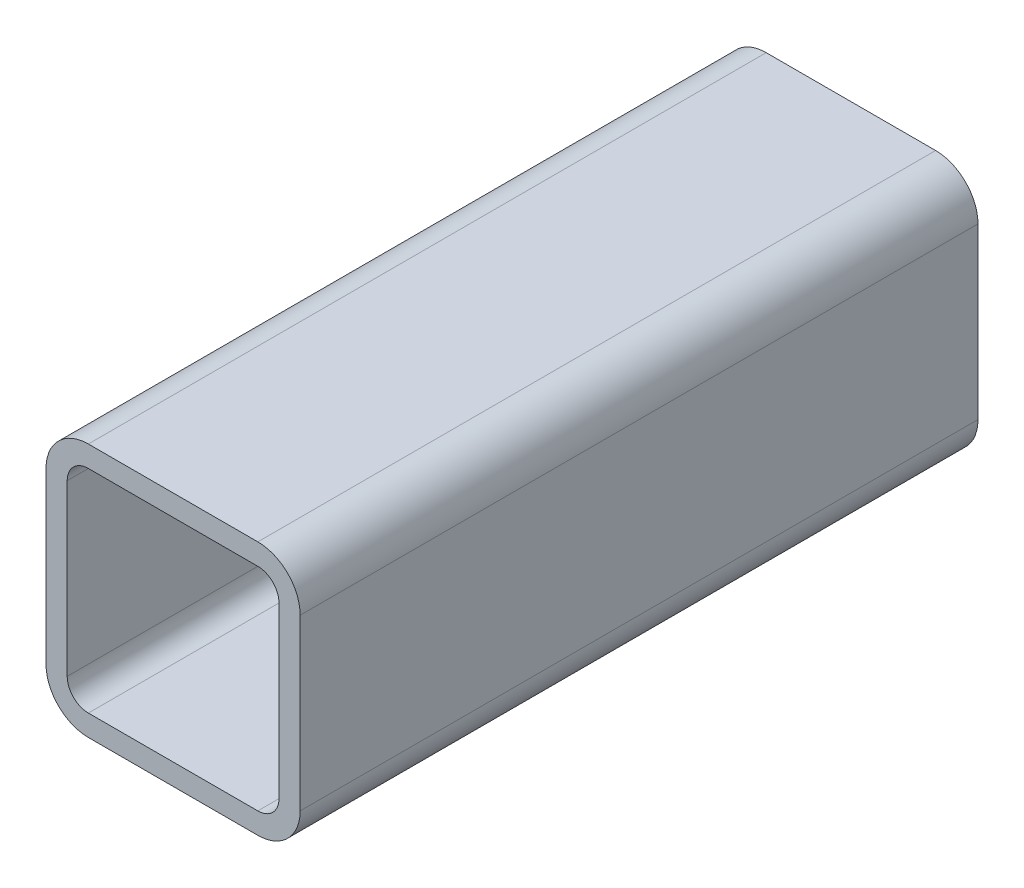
ISO-10303-21;
HEADER;
FILE_DESCRIPTION(('STEP AP214'),'2;1');
FILE_NAME('part.step','',(''),(''),'','','');
FILE_SCHEMA(('AUTOMOTIVE_DESIGN { 1 0 10303 214 1 1 1 1 }'));
ENDSEC;
DATA;
#1=APPLICATION_CONTEXT('core data for automotive mechanical design processes');
#2=APPLICATION_PROTOCOL_DEFINITION('international standard','automotive_design',2000,#1);
#3=PRODUCT_CONTEXT('',#1,'mechanical');
#4=PRODUCT('Part','Part','',(#3));
#5=PRODUCT_RELATED_PRODUCT_CATEGORY('part','',(#4));
#6=PRODUCT_DEFINITION_FORMATION('','',#4);
#7=PRODUCT_DEFINITION_CONTEXT('part definition',#1,'design');
#8=PRODUCT_DEFINITION('design','',#6,#7);
#9=PRODUCT_DEFINITION_SHAPE('','',#8);
#10=(LENGTH_UNIT() NAMED_UNIT(*) SI_UNIT(.MILLI.,.METRE.));
#11=(NAMED_UNIT(*) PLANE_ANGLE_UNIT() SI_UNIT($,.RADIAN.));
#12=(NAMED_UNIT(*) SI_UNIT($,.STERADIAN.) SOLID_ANGLE_UNIT());
#13=UNCERTAINTY_MEASURE_WITH_UNIT(LENGTH_MEASURE(1.E-05),#10,'distance_accuracy_value','');
#14=(GEOMETRIC_REPRESENTATION_CONTEXT(3) GLOBAL_UNCERTAINTY_ASSIGNED_CONTEXT((#13)) GLOBAL_UNIT_ASSIGNED_CONTEXT((#10,
#11,#12)) REPRESENTATION_CONTEXT('',''));
#15=CARTESIAN_POINT('',(0.,0.,0.));
#16=DIRECTION('',(0.,0.,1.));
#17=DIRECTION('',(1.,0.,0.));
#18=AXIS2_PLACEMENT_3D('',#15,#16,#17);
#19=CARTESIAN_POINT('',(20.3182087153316,96.0286017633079,304.8));
#20=DIRECTION('',(0.,0.,1.));
#21=DIRECTION('',(1.,0.,0.));
#22=AXIS2_PLACEMENT_3D('',#19,#20,#21);
#23=PLANE('',#22);
#24=CARTESIAN_POINT('',(20.3182087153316,96.0286017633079,304.8));
#25=DIRECTION('',(0.,0.,1.));
#26=DIRECTION('',(1.,0.,0.));
#27=AXIS2_PLACEMENT_3D('',#24,#25,#26);
#28=CIRCLE('',#27,19.05);
#29=CARTESIAN_POINT('',(20.3182087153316,115.078601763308,304.8));
#30=VERTEX_POINT('',#29);
#31=CARTESIAN_POINT('',(1.26820871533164,96.0286017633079,304.8));
#32=VERTEX_POINT('',#31);
#33=EDGE_CURVE('E211',#30,#32,#28,.T.);
#34=ORIENTED_EDGE('',*,*,#33,.T.);
#35=DIRECTION('',(0.,-1.,0.));
#36=VECTOR('',#35,1.);
#37=CARTESIAN_POINT('',(1.26820871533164,19.8286017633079,304.8));
#38=LINE('',#37,#36);
#39=CARTESIAN_POINT('',(1.26820871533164,19.8286017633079,304.8));
#40=VERTEX_POINT('',#39);
#41=EDGE_CURVE('E214',#32,#40,#38,.T.);
#42=ORIENTED_EDGE('',*,*,#41,.T.);
#43=CARTESIAN_POINT('',(20.3182087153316,19.8286017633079,304.8));
#44=DIRECTION('',(0.,0.,1.));
#45=DIRECTION('',(1.,0.,0.));
#46=AXIS2_PLACEMENT_3D('',#43,#44,#45);
#47=CIRCLE('',#46,19.05);
#48=CARTESIAN_POINT('',(20.3182087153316,0.77860176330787,304.8));
#49=VERTEX_POINT('',#48);
#50=EDGE_CURVE('E217',#40,#49,#47,.T.);
#51=ORIENTED_EDGE('',*,*,#50,.T.);
#52=DIRECTION('',(1.,0.,0.));
#53=VECTOR('',#52,1.);
#54=CARTESIAN_POINT('',(96.5182087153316,0.77860176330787,304.8));
#55=LINE('',#54,#53);
#56=CARTESIAN_POINT('',(96.5182087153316,0.778601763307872,304.8));
#57=VERTEX_POINT('',#56);
#58=EDGE_CURVE('E219',#49,#57,#55,.T.);
#59=ORIENTED_EDGE('',*,*,#58,.T.);
#60=CARTESIAN_POINT('',(96.5182087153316,19.8286017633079,304.8));
#61=DIRECTION('',(0.,0.,1.));
#62=DIRECTION('',(1.,0.,0.));
#63=AXIS2_PLACEMENT_3D('',#60,#61,#62);
#64=CIRCLE('',#63,19.05);
#65=CARTESIAN_POINT('',(115.568208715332,19.8286017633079,304.8));
#66=VERTEX_POINT('',#65);
#67=EDGE_CURVE('E221',#57,#66,#64,.T.);
#68=ORIENTED_EDGE('',*,*,#67,.T.);
#69=DIRECTION('',(0.,1.,0.));
#70=VECTOR('',#69,1.);
#71=CARTESIAN_POINT('',(115.568208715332,96.0286017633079,304.8));
#72=LINE('',#71,#70);
#73=CARTESIAN_POINT('',(115.568208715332,96.0286017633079,304.8));
#74=VERTEX_POINT('',#73);
#75=EDGE_CURVE('E223',#66,#74,#72,.T.);
#76=ORIENTED_EDGE('',*,*,#75,.T.);
#77=CARTESIAN_POINT('',(96.5182087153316,96.0286017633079,304.8));
#78=DIRECTION('',(0.,0.,1.));
#79=DIRECTION('',(1.,0.,0.));
#80=AXIS2_PLACEMENT_3D('',#77,#78,#79);
#81=CIRCLE('',#80,19.05);
#82=CARTESIAN_POINT('',(96.5182087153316,115.078601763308,304.8));
#83=VERTEX_POINT('',#82);
#84=EDGE_CURVE('E225',#74,#83,#81,.T.);
#85=ORIENTED_EDGE('',*,*,#84,.T.);
#86=DIRECTION('',(-1.,0.,0.));
#87=VECTOR('',#86,1.);
#88=CARTESIAN_POINT('',(20.3182087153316,115.078601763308,304.8));
#89=LINE('',#88,#87);
#90=EDGE_CURVE('E227',#83,#30,#89,.T.);
#91=ORIENTED_EDGE('',*,*,#90,.T.);
#92=EDGE_LOOP('',(#34,#42,#51,#59,#68,#76,#85,#91));
#93=FACE_BOUND('',#92,.T.);
#94=DIRECTION('',(0.,-1.,0.));
#95=VECTOR('',#94,1.);
#96=CARTESIAN_POINT('',(10.7932087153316,19.8286017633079,304.8));
#97=LINE('',#96,#95);
#98=CARTESIAN_POINT('',(10.7932087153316,96.0286017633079,304.8));
#99=VERTEX_POINT('',#98);
#100=CARTESIAN_POINT('',(10.7932087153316,19.8286017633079,304.8));
#101=VERTEX_POINT('',#100);
#102=EDGE_CURVE('E154',#99,#101,#97,.T.);
#103=ORIENTED_EDGE('',*,*,#102,.F.);
#104=CARTESIAN_POINT('',(20.3182087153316,96.0286017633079,304.8));
#105=DIRECTION('',(0.,0.,1.));
#106=DIRECTION('',(1.,0.,0.));
#107=AXIS2_PLACEMENT_3D('',#104,#105,#106);
#108=CIRCLE('',#107,9.52500000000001);
#109=CARTESIAN_POINT('',(20.3182087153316,105.553601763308,304.8));
#110=VERTEX_POINT('',#109);
#111=EDGE_CURVE('E146',#110,#99,#108,.T.);
#112=ORIENTED_EDGE('',*,*,#111,.F.);
#113=DIRECTION('',(-1.,0.,0.));
#114=VECTOR('',#113,1.);
#115=CARTESIAN_POINT('',(20.3182087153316,105.553601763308,304.8));
#116=LINE('',#115,#114);
#117=CARTESIAN_POINT('',(96.5182087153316,105.553601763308,304.8));
#118=VERTEX_POINT('',#117);
#119=EDGE_CURVE('E179',#118,#110,#116,.T.);
#120=ORIENTED_EDGE('',*,*,#119,.F.);
#121=CARTESIAN_POINT('',(96.5182087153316,96.0286017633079,304.8));
#122=DIRECTION('',(0.,0.,1.));
#123=DIRECTION('',(1.,0.,0.));
#124=AXIS2_PLACEMENT_3D('',#121,#122,#123);
#125=CIRCLE('',#124,9.52500000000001);
#126=CARTESIAN_POINT('',(106.043208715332,96.0286017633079,304.8));
#127=VERTEX_POINT('',#126);
#128=EDGE_CURVE('E177',#127,#118,#125,.T.);
#129=ORIENTED_EDGE('',*,*,#128,.F.);
#130=DIRECTION('',(0.,1.,0.));
#131=VECTOR('',#130,1.);
#132=CARTESIAN_POINT('',(106.043208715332,96.0286017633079,304.8));
#133=LINE('',#132,#131);
#134=CARTESIAN_POINT('',(106.043208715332,19.8286017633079,304.8));
#135=VERTEX_POINT('',#134);
#136=EDGE_CURVE('E175',#135,#127,#133,.T.);
#137=ORIENTED_EDGE('',*,*,#136,.F.);
#138=CARTESIAN_POINT('',(96.5182087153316,19.8286017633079,304.8));
#139=DIRECTION('',(0.,0.,1.));
#140=DIRECTION('',(1.,0.,0.));
#141=AXIS2_PLACEMENT_3D('',#138,#139,#140);
#142=CIRCLE('',#141,9.525);
#143=CARTESIAN_POINT('',(96.5182087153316,10.3036017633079,304.8));
#144=VERTEX_POINT('',#143);
#145=EDGE_CURVE('E173',#144,#135,#142,.T.);
#146=ORIENTED_EDGE('',*,*,#145,.F.);
#147=DIRECTION('',(1.,0.,0.));
#148=VECTOR('',#147,1.);
#149=CARTESIAN_POINT('',(96.5182087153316,10.3036017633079,304.8));
#150=LINE('',#149,#148);
#151=CARTESIAN_POINT('',(20.3182087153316,10.3036017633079,304.8));
#152=VERTEX_POINT('',#151);
#153=EDGE_CURVE('E169',#152,#144,#150,.T.);
#154=ORIENTED_EDGE('',*,*,#153,.F.);
#155=CARTESIAN_POINT('',(20.3182087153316,19.8286017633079,304.8));
#156=DIRECTION('',(0.,0.,1.));
#157=DIRECTION('',(1.,0.,0.));
#158=AXIS2_PLACEMENT_3D('',#155,#156,#157);
#159=CIRCLE('',#158,9.525);
#160=EDGE_CURVE('E167',#101,#152,#159,.T.);
#161=ORIENTED_EDGE('',*,*,#160,.F.);
#162=EDGE_LOOP('',(#103,#112,#120,#129,#137,#146,#154,#161));
#163=FACE_BOUND('',#162,.T.);
#164=ADVANCED_FACE('F33',(#93,#163),#23,.T.);
#165=CARTESIAN_POINT('',(20.3182087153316,96.0286017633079,0.));
#166=DIRECTION('',(0.,0.,1.));
#167=DIRECTION('',(1.,0.,0.));
#168=AXIS2_PLACEMENT_3D('',#165,#166,#167);
#169=PLANE('',#168);
#170=CARTESIAN_POINT('',(20.3182087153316,96.0286017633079,0.));
#171=DIRECTION('',(0.,0.,1.));
#172=DIRECTION('',(1.,0.,0.));
#173=AXIS2_PLACEMENT_3D('',#170,#171,#172);
#174=CIRCLE('',#173,19.05);
#175=CARTESIAN_POINT('',(20.3182087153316,115.078601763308,0.));
#176=VERTEX_POINT('',#175);
#177=CARTESIAN_POINT('',(1.26820871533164,96.0286017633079,0.));
#178=VERTEX_POINT('',#177);
#179=EDGE_CURVE('E162',#176,#178,#174,.T.);
#180=ORIENTED_EDGE('',*,*,#179,.F.);
#181=DIRECTION('',(-1.,0.,0.));
#182=VECTOR('',#181,1.);
#183=CARTESIAN_POINT('',(20.3182087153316,115.078601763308,0.));
#184=LINE('',#183,#182);
#185=CARTESIAN_POINT('',(96.5182087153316,115.078601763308,0.));
#186=VERTEX_POINT('',#185);
#187=EDGE_CURVE('E215',#186,#176,#184,.T.);
#188=ORIENTED_EDGE('',*,*,#187,.F.);
#189=CARTESIAN_POINT('',(96.5182087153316,96.0286017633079,0.));
#190=DIRECTION('',(0.,0.,1.));
#191=DIRECTION('',(1.,0.,0.));
#192=AXIS2_PLACEMENT_3D('',#189,#190,#191);
#193=CIRCLE('',#192,19.05);
#194=CARTESIAN_POINT('',(115.568208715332,96.0286017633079,0.));
#195=VERTEX_POINT('',#194);
#196=EDGE_CURVE('E242',#195,#186,#193,.T.);
#197=ORIENTED_EDGE('',*,*,#196,.F.);
#198=DIRECTION('',(0.,1.,0.));
#199=VECTOR('',#198,1.);
#200=CARTESIAN_POINT('',(115.568208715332,96.0286017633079,0.));
#201=LINE('',#200,#199);
#202=CARTESIAN_POINT('',(115.568208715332,19.8286017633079,0.));
#203=VERTEX_POINT('',#202);
#204=EDGE_CURVE('E240',#203,#195,#201,.T.);
#205=ORIENTED_EDGE('',*,*,#204,.F.);
#206=CARTESIAN_POINT('',(96.5182087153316,19.8286017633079,0.));
#207=DIRECTION('',(0.,0.,1.));
#208=DIRECTION('',(1.,0.,0.));
#209=AXIS2_PLACEMENT_3D('',#206,#207,#208);
#210=CIRCLE('',#209,19.05);
#211=CARTESIAN_POINT('',(96.5182087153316,0.778601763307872,0.));
#212=VERTEX_POINT('',#211);
#213=EDGE_CURVE('E238',#212,#203,#210,.T.);
#214=ORIENTED_EDGE('',*,*,#213,.F.);
#215=DIRECTION('',(1.,0.,0.));
#216=VECTOR('',#215,1.);
#217=CARTESIAN_POINT('',(96.5182087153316,0.77860176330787,0.));
#218=LINE('',#217,#216);
#219=CARTESIAN_POINT('',(20.3182087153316,0.77860176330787,0.));
#220=VERTEX_POINT('',#219);
#221=EDGE_CURVE('E236',#220,#212,#218,.T.);
#222=ORIENTED_EDGE('',*,*,#221,.F.);
#223=CARTESIAN_POINT('',(20.3182087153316,19.8286017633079,0.));
#224=DIRECTION('',(0.,0.,1.));
#225=DIRECTION('',(1.,0.,0.));
#226=AXIS2_PLACEMENT_3D('',#223,#224,#225);
#227=CIRCLE('',#226,19.05);
#228=CARTESIAN_POINT('',(1.26820871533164,19.8286017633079,0.));
#229=VERTEX_POINT('',#228);
#230=EDGE_CURVE('E234',#229,#220,#227,.T.);
#231=ORIENTED_EDGE('',*,*,#230,.F.);
#232=DIRECTION('',(0.,-1.,0.));
#233=VECTOR('',#232,1.);
#234=CARTESIAN_POINT('',(1.26820871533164,19.8286017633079,0.));
#235=LINE('',#234,#233);
#236=EDGE_CURVE('E232',#178,#229,#235,.T.);
#237=ORIENTED_EDGE('',*,*,#236,.F.);
#238=EDGE_LOOP('',(#180,#188,#197,#205,#214,#222,#231,#237));
#239=FACE_BOUND('',#238,.T.);
#240=CARTESIAN_POINT('',(20.3182087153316,96.0286017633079,0.));
#241=DIRECTION('',(0.,0.,1.));
#242=DIRECTION('',(1.,0.,0.));
#243=AXIS2_PLACEMENT_3D('',#240,#241,#242);
#244=CIRCLE('',#243,9.52500000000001);
#245=CARTESIAN_POINT('',(20.3182087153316,105.553601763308,0.));
#246=VERTEX_POINT('',#245);
#247=CARTESIAN_POINT('',(10.7932087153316,96.0286017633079,0.));
#248=VERTEX_POINT('',#247);
#249=EDGE_CURVE('E56',#246,#248,#244,.T.);
#250=ORIENTED_EDGE('',*,*,#249,.T.);
#251=DIRECTION('',(0.,-1.,0.));
#252=VECTOR('',#251,1.);
#253=CARTESIAN_POINT('',(10.7932087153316,19.8286017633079,0.));
#254=LINE('',#253,#252);
#255=CARTESIAN_POINT('',(10.7932087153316,19.8286017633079,0.));
#256=VERTEX_POINT('',#255);
#257=EDGE_CURVE('E161',#248,#256,#254,.T.);
#258=ORIENTED_EDGE('',*,*,#257,.T.);
#259=CARTESIAN_POINT('',(20.3182087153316,19.8286017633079,0.));
#260=DIRECTION('',(0.,0.,1.));
#261=DIRECTION('',(1.,0.,0.));
#262=AXIS2_PLACEMENT_3D('',#259,#260,#261);
#263=CIRCLE('',#262,9.525);
#264=CARTESIAN_POINT('',(20.3182087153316,10.3036017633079,0.));
#265=VERTEX_POINT('',#264);
#266=EDGE_CURVE('E183',#256,#265,#263,.T.);
#267=ORIENTED_EDGE('',*,*,#266,.T.);
#268=DIRECTION('',(1.,0.,0.));
#269=VECTOR('',#268,1.);
#270=CARTESIAN_POINT('',(96.5182087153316,10.3036017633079,0.));
#271=LINE('',#270,#269);
#272=CARTESIAN_POINT('',(96.5182087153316,10.3036017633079,0.));
#273=VERTEX_POINT('',#272);
#274=EDGE_CURVE('E186',#265,#273,#271,.T.);
#275=ORIENTED_EDGE('',*,*,#274,.T.);
#276=CARTESIAN_POINT('',(96.5182087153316,19.8286017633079,0.));
#277=DIRECTION('',(0.,0.,1.));
#278=DIRECTION('',(1.,0.,0.));
#279=AXIS2_PLACEMENT_3D('',#276,#277,#278);
#280=CIRCLE('',#279,9.525);
#281=CARTESIAN_POINT('',(106.043208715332,19.8286017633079,0.));
#282=VERTEX_POINT('',#281);
#283=EDGE_CURVE('E189',#273,#282,#280,.T.);
#284=ORIENTED_EDGE('',*,*,#283,.T.);
#285=DIRECTION('',(0.,1.,0.));
#286=VECTOR('',#285,1.);
#287=CARTESIAN_POINT('',(106.043208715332,96.0286017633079,0.));
#288=LINE('',#287,#286);
#289=CARTESIAN_POINT('',(106.043208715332,96.0286017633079,0.));
#290=VERTEX_POINT('',#289);
#291=EDGE_CURVE('E192',#282,#290,#288,.T.);
#292=ORIENTED_EDGE('',*,*,#291,.T.);
#293=CARTESIAN_POINT('',(96.5182087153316,96.0286017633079,0.));
#294=DIRECTION('',(0.,0.,1.));
#295=DIRECTION('',(1.,0.,0.));
#296=AXIS2_PLACEMENT_3D('',#293,#294,#295);
#297=CIRCLE('',#296,9.52500000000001);
#298=CARTESIAN_POINT('',(96.5182087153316,105.553601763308,0.));
#299=VERTEX_POINT('',#298);
#300=EDGE_CURVE('E195',#290,#299,#297,.T.);
#301=ORIENTED_EDGE('',*,*,#300,.T.);
#302=DIRECTION('',(-1.,0.,0.));
#303=VECTOR('',#302,1.);
#304=CARTESIAN_POINT('',(20.3182087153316,105.553601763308,0.));
#305=LINE('',#304,#303);
#306=EDGE_CURVE('E155',#299,#246,#305,.T.);
#307=ORIENTED_EDGE('',*,*,#306,.T.);
#308=EDGE_LOOP('',(#250,#258,#267,#275,#284,#292,#301,#307));
#309=FACE_BOUND('',#308,.T.);
#310=ADVANCED_FACE('F272',(#239,#309),#169,.F.);
#311=CARTESIAN_POINT('',(20.3182087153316,96.0286017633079,304.8));
#312=DIRECTION('',(0.,0.,-1.));
#313=DIRECTION('',(-1.,0.,0.));
#314=AXIS2_PLACEMENT_3D('',#311,#312,#313);
#315=CYLINDRICAL_SURFACE('',#314,19.05);
#316=ORIENTED_EDGE('',*,*,#179,.T.);
#317=DIRECTION('',(0.,0.,-1.));
#318=VECTOR('',#317,1.);
#319=CARTESIAN_POINT('',(1.26820871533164,96.0286017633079,304.8));
#320=LINE('',#319,#318);
#321=EDGE_CURVE('E11',#32,#178,#320,.T.);
#322=ORIENTED_EDGE('',*,*,#321,.F.);
#323=ORIENTED_EDGE('',*,*,#33,.F.);
#324=DIRECTION('',(0.,0.,-1.));
#325=VECTOR('',#324,1.);
#326=CARTESIAN_POINT('',(20.3182087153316,115.078601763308,304.8));
#327=LINE('',#326,#325);
#328=EDGE_CURVE('E229',#30,#176,#327,.T.);
#329=ORIENTED_EDGE('',*,*,#328,.T.);
#330=EDGE_LOOP('',(#316,#322,#323,#329));
#331=FACE_BOUND('',#330,.T.);
#332=ADVANCED_FACE('F35',(#331),#315,.T.);
#333=CARTESIAN_POINT('',(1.26820871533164,19.8286017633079,304.8));
#334=DIRECTION('',(1.,0.,0.));
#335=DIRECTION('',(0.,0.,-1.));
#336=AXIS2_PLACEMENT_3D('',#333,#334,#335);
#337=PLANE('',#336);
#338=ORIENTED_EDGE('',*,*,#236,.T.);
#339=DIRECTION('',(0.,0.,-1.));
#340=VECTOR('',#339,1.);
#341=CARTESIAN_POINT('',(1.26820871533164,19.8286017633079,304.8));
#342=LINE('',#341,#340);
#343=EDGE_CURVE('E41',#40,#229,#342,.T.);
#344=ORIENTED_EDGE('',*,*,#343,.F.);
#345=ORIENTED_EDGE('',*,*,#41,.F.);
#346=ORIENTED_EDGE('',*,*,#321,.T.);
#347=EDGE_LOOP('',(#338,#344,#345,#346));
#348=FACE_BOUND('',#347,.T.);
#349=ADVANCED_FACE('F289',(#348),#337,.F.);
#350=CARTESIAN_POINT('',(20.3182087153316,19.8286017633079,304.8));
#351=DIRECTION('',(0.,0.,-1.));
#352=DIRECTION('',(-1.,0.,0.));
#353=AXIS2_PLACEMENT_3D('',#350,#351,#352);
#354=CYLINDRICAL_SURFACE('',#353,19.05);
#355=ORIENTED_EDGE('',*,*,#230,.T.);
#356=DIRECTION('',(0.,0.,-1.));
#357=VECTOR('',#356,1.);
#358=CARTESIAN_POINT('',(20.3182087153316,0.77860176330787,304.8));
#359=LINE('',#358,#357);
#360=EDGE_CURVE('E259',#49,#220,#359,.T.);
#361=ORIENTED_EDGE('',*,*,#360,.F.);
#362=ORIENTED_EDGE('',*,*,#50,.F.);
#363=ORIENTED_EDGE('',*,*,#343,.T.);
#364=EDGE_LOOP('',(#355,#361,#362,#363));
#365=FACE_BOUND('',#364,.T.);
#366=ADVANCED_FACE('F266',(#365),#354,.T.);
#367=CARTESIAN_POINT('',(96.5182087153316,0.77860176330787,304.8));
#368=DIRECTION('',(0.,1.,0.));
#369=DIRECTION('',(0.,0.,1.));
#370=AXIS2_PLACEMENT_3D('',#367,#368,#369);
#371=PLANE('',#370);
#372=ORIENTED_EDGE('',*,*,#221,.T.);
#373=DIRECTION('',(0.,0.,-1.));
#374=VECTOR('',#373,1.);
#375=CARTESIAN_POINT('',(96.5182087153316,0.778601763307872,304.8));
#376=LINE('',#375,#374);
#377=EDGE_CURVE('E256',#57,#212,#376,.T.);
#378=ORIENTED_EDGE('',*,*,#377,.F.);
#379=ORIENTED_EDGE('',*,*,#58,.F.);
#380=ORIENTED_EDGE('',*,*,#360,.T.);
#381=EDGE_LOOP('',(#372,#378,#379,#380));
#382=FACE_BOUND('',#381,.T.);
#383=ADVANCED_FACE('F278',(#382),#371,.F.);
#384=CARTESIAN_POINT('',(96.5182087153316,19.8286017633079,304.8));
#385=DIRECTION('',(0.,0.,-1.));
#386=DIRECTION('',(-1.,0.,0.));
#387=AXIS2_PLACEMENT_3D('',#384,#385,#386);
#388=CYLINDRICAL_SURFACE('',#387,19.05);
#389=ORIENTED_EDGE('',*,*,#213,.T.);
#390=DIRECTION('',(0.,0.,-1.));
#391=VECTOR('',#390,1.);
#392=CARTESIAN_POINT('',(115.568208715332,19.8286017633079,304.8));
#393=LINE('',#392,#391);
#394=EDGE_CURVE('E253',#66,#203,#393,.T.);
#395=ORIENTED_EDGE('',*,*,#394,.F.);
#396=ORIENTED_EDGE('',*,*,#67,.F.);
#397=ORIENTED_EDGE('',*,*,#377,.T.);
#398=EDGE_LOOP('',(#389,#395,#396,#397));
#399=FACE_BOUND('',#398,.T.);
#400=ADVANCED_FACE('F282',(#399),#388,.T.);
#401=CARTESIAN_POINT('',(115.568208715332,96.0286017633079,304.8));
#402=DIRECTION('',(-1.,0.,0.));
#403=DIRECTION('',(0.,0.,1.));
#404=AXIS2_PLACEMENT_3D('',#401,#402,#403);
#405=PLANE('',#404);
#406=ORIENTED_EDGE('',*,*,#204,.T.);
#407=DIRECTION('',(0.,0.,-1.));
#408=VECTOR('',#407,1.);
#409=CARTESIAN_POINT('',(115.568208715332,96.0286017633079,304.8));
#410=LINE('',#409,#408);
#411=EDGE_CURVE('E250',#74,#195,#410,.T.);
#412=ORIENTED_EDGE('',*,*,#411,.F.);
#413=ORIENTED_EDGE('',*,*,#75,.F.);
#414=ORIENTED_EDGE('',*,*,#394,.T.);
#415=EDGE_LOOP('',(#406,#412,#413,#414));
#416=FACE_BOUND('',#415,.T.);
#417=ADVANCED_FACE('F302',(#416),#405,.F.);
#418=CARTESIAN_POINT('',(96.5182087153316,96.0286017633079,304.8));
#419=DIRECTION('',(0.,0.,-1.));
#420=DIRECTION('',(-1.,0.,0.));
#421=AXIS2_PLACEMENT_3D('',#418,#419,#420);
#422=CYLINDRICAL_SURFACE('',#421,19.05);
#423=ORIENTED_EDGE('',*,*,#196,.T.);
#424=DIRECTION('',(0.,0.,-1.));
#425=VECTOR('',#424,1.);
#426=CARTESIAN_POINT('',(96.5182087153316,115.078601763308,304.8));
#427=LINE('',#426,#425);
#428=EDGE_CURVE('E247',#83,#186,#427,.T.);
#429=ORIENTED_EDGE('',*,*,#428,.F.);
#430=ORIENTED_EDGE('',*,*,#84,.F.);
#431=ORIENTED_EDGE('',*,*,#411,.T.);
#432=EDGE_LOOP('',(#423,#429,#430,#431));
#433=FACE_BOUND('',#432,.T.);
#434=ADVANCED_FACE('F300',(#433),#422,.T.);
#435=CARTESIAN_POINT('',(20.3182087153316,115.078601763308,304.8));
#436=DIRECTION('',(0.,-1.,0.));
#437=DIRECTION('',(0.,0.,-1.));
#438=AXIS2_PLACEMENT_3D('',#435,#436,#437);
#439=PLANE('',#438);
#440=ORIENTED_EDGE('',*,*,#187,.T.);
#441=ORIENTED_EDGE('',*,*,#328,.F.);
#442=ORIENTED_EDGE('',*,*,#90,.F.);
#443=ORIENTED_EDGE('',*,*,#428,.T.);
#444=EDGE_LOOP('',(#440,#441,#442,#443));
#445=FACE_BOUND('',#444,.T.);
#446=ADVANCED_FACE('F295',(#445),#439,.F.);
#447=CARTESIAN_POINT('',(20.3182087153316,96.0286017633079,304.8));
#448=DIRECTION('',(0.,0.,-1.));
#449=DIRECTION('',(-1.,0.,0.));
#450=AXIS2_PLACEMENT_3D('',#447,#448,#449);
#451=CYLINDRICAL_SURFACE('',#450,9.52500000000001);
#452=ORIENTED_EDGE('',*,*,#249,.F.);
#453=DIRECTION('',(0.,0.,-1.));
#454=VECTOR('',#453,1.);
#455=CARTESIAN_POINT('',(20.3182087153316,105.553601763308,304.8));
#456=LINE('',#455,#454);
#457=EDGE_CURVE('E150',#110,#246,#456,.T.);
#458=ORIENTED_EDGE('',*,*,#457,.F.);
#459=ORIENTED_EDGE('',*,*,#111,.T.);
#460=DIRECTION('',(0.,0.,-1.));
#461=VECTOR('',#460,1.);
#462=CARTESIAN_POINT('',(10.7932087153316,96.0286017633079,304.8));
#463=LINE('',#462,#461);
#464=EDGE_CURVE('E149',#99,#248,#463,.T.);
#465=ORIENTED_EDGE('',*,*,#464,.T.);
#466=EDGE_LOOP('',(#452,#458,#459,#465));
#467=FACE_BOUND('',#466,.T.);
#468=ADVANCED_FACE('F148',(#467),#451,.F.);
#469=CARTESIAN_POINT('',(10.7932087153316,19.8286017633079,304.8));
#470=DIRECTION('',(1.,0.,0.));
#471=DIRECTION('',(0.,0.,-1.));
#472=AXIS2_PLACEMENT_3D('',#469,#470,#471);
#473=PLANE('',#472);
#474=ORIENTED_EDGE('',*,*,#257,.F.);
#475=ORIENTED_EDGE('',*,*,#464,.F.);
#476=ORIENTED_EDGE('',*,*,#102,.T.);
#477=DIRECTION('',(0.,0.,-1.));
#478=VECTOR('',#477,1.);
#479=CARTESIAN_POINT('',(10.7932087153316,19.8286017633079,304.8));
#480=LINE('',#479,#478);
#481=EDGE_CURVE('E163',#101,#256,#480,.T.);
#482=ORIENTED_EDGE('',*,*,#481,.T.);
#483=EDGE_LOOP('',(#474,#475,#476,#482));
#484=FACE_BOUND('',#483,.T.);
#485=ADVANCED_FACE('F158',(#484),#473,.T.);
#486=CARTESIAN_POINT('',(20.3182087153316,19.8286017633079,304.8));
#487=DIRECTION('',(0.,0.,-1.));
#488=DIRECTION('',(-1.,0.,0.));
#489=AXIS2_PLACEMENT_3D('',#486,#487,#488);
#490=CYLINDRICAL_SURFACE('',#489,9.525);
#491=ORIENTED_EDGE('',*,*,#266,.F.);
#492=ORIENTED_EDGE('',*,*,#481,.F.);
#493=ORIENTED_EDGE('',*,*,#160,.T.);
#494=DIRECTION('',(0.,0.,-1.));
#495=VECTOR('',#494,1.);
#496=CARTESIAN_POINT('',(20.3182087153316,10.3036017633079,304.8));
#497=LINE('',#496,#495);
#498=EDGE_CURVE('E208',#152,#265,#497,.T.);
#499=ORIENTED_EDGE('',*,*,#498,.T.);
#500=EDGE_LOOP('',(#491,#492,#493,#499));
#501=FACE_BOUND('',#500,.T.);
#502=ADVANCED_FACE('F327',(#501),#490,.F.);
#503=CARTESIAN_POINT('',(96.5182087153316,10.3036017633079,304.8));
#504=DIRECTION('',(0.,1.,0.));
#505=DIRECTION('',(0.,0.,1.));
#506=AXIS2_PLACEMENT_3D('',#503,#504,#505);
#507=PLANE('',#506);
#508=ORIENTED_EDGE('',*,*,#274,.F.);
#509=ORIENTED_EDGE('',*,*,#498,.F.);
#510=ORIENTED_EDGE('',*,*,#153,.T.);
#511=DIRECTION('',(0.,0.,-1.));
#512=VECTOR('',#511,1.);
#513=CARTESIAN_POINT('',(96.5182087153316,10.3036017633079,304.8));
#514=LINE('',#513,#512);
#515=EDGE_CURVE('E206',#144,#273,#514,.T.);
#516=ORIENTED_EDGE('',*,*,#515,.T.);
#517=EDGE_LOOP('',(#508,#509,#510,#516));
#518=FACE_BOUND('',#517,.T.);
#519=ADVANCED_FACE('F331',(#518),#507,.T.);
#520=CARTESIAN_POINT('',(96.5182087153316,19.8286017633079,304.8));
#521=DIRECTION('',(0.,0.,-1.));
#522=DIRECTION('',(-1.,0.,0.));
#523=AXIS2_PLACEMENT_3D('',#520,#521,#522);
#524=CYLINDRICAL_SURFACE('',#523,9.525);
#525=ORIENTED_EDGE('',*,*,#283,.F.);
#526=ORIENTED_EDGE('',*,*,#515,.F.);
#527=ORIENTED_EDGE('',*,*,#145,.T.);
#528=DIRECTION('',(0.,0.,-1.));
#529=VECTOR('',#528,1.);
#530=CARTESIAN_POINT('',(106.043208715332,19.8286017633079,304.8));
#531=LINE('',#530,#529);
#532=EDGE_CURVE('E204',#135,#282,#531,.T.);
#533=ORIENTED_EDGE('',*,*,#532,.T.);
#534=EDGE_LOOP('',(#525,#526,#527,#533));
#535=FACE_BOUND('',#534,.T.);
#536=ADVANCED_FACE('F337',(#535),#524,.F.);
#537=CARTESIAN_POINT('',(106.043208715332,96.0286017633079,304.8));
#538=DIRECTION('',(-1.,0.,0.));
#539=DIRECTION('',(0.,0.,1.));
#540=AXIS2_PLACEMENT_3D('',#537,#538,#539);
#541=PLANE('',#540);
#542=ORIENTED_EDGE('',*,*,#291,.F.);
#543=ORIENTED_EDGE('',*,*,#532,.F.);
#544=ORIENTED_EDGE('',*,*,#136,.T.);
#545=DIRECTION('',(0.,0.,-1.));
#546=VECTOR('',#545,1.);
#547=CARTESIAN_POINT('',(106.043208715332,96.0286017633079,304.8));
#548=LINE('',#547,#546);
#549=EDGE_CURVE('E202',#127,#290,#548,.T.);
#550=ORIENTED_EDGE('',*,*,#549,.T.);
#551=EDGE_LOOP('',(#542,#543,#544,#550));
#552=FACE_BOUND('',#551,.T.);
#553=ADVANCED_FACE('F341',(#552),#541,.T.);
#554=CARTESIAN_POINT('',(96.5182087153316,96.0286017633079,304.8));
#555=DIRECTION('',(0.,0.,-1.));
#556=DIRECTION('',(-1.,0.,0.));
#557=AXIS2_PLACEMENT_3D('',#554,#555,#556);
#558=CYLINDRICAL_SURFACE('',#557,9.52500000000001);
#559=ORIENTED_EDGE('',*,*,#300,.F.);
#560=ORIENTED_EDGE('',*,*,#549,.F.);
#561=ORIENTED_EDGE('',*,*,#128,.T.);
#562=DIRECTION('',(0.,0.,-1.));
#563=VECTOR('',#562,1.);
#564=CARTESIAN_POINT('',(96.5182087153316,105.553601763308,304.8));
#565=LINE('',#564,#563);
#566=EDGE_CURVE('E48',#118,#299,#565,.T.);
#567=ORIENTED_EDGE('',*,*,#566,.T.);
#568=EDGE_LOOP('',(#559,#560,#561,#567));
#569=FACE_BOUND('',#568,.T.);
#570=ADVANCED_FACE('F345',(#569),#558,.F.);
#571=CARTESIAN_POINT('',(20.3182087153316,105.553601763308,304.8));
#572=DIRECTION('',(0.,-1.,0.));
#573=DIRECTION('',(0.,0.,-1.));
#574=AXIS2_PLACEMENT_3D('',#571,#572,#573);
#575=PLANE('',#574);
#576=ORIENTED_EDGE('',*,*,#306,.F.);
#577=ORIENTED_EDGE('',*,*,#566,.F.);
#578=ORIENTED_EDGE('',*,*,#119,.T.);
#579=ORIENTED_EDGE('',*,*,#457,.T.);
#580=EDGE_LOOP('',(#576,#577,#578,#579));
#581=FACE_BOUND('',#580,.T.);
#582=ADVANCED_FACE('F349',(#581),#575,.T.);
#583=CLOSED_SHELL('',(#164,#310,#332,#349,#366,#383,#400,#417,#434,#446,#468,#485,#502,#519,
#536,#553,#570,#582));
#584=MANIFOLD_SOLID_BREP('B2',#583);
#585=ADVANCED_BREP_SHAPE_REPRESENTATION('',(#18,#584),#14);
#586=SHAPE_DEFINITION_REPRESENTATION(#9,#585);
ENDSEC;
END-ISO-10303-21;
